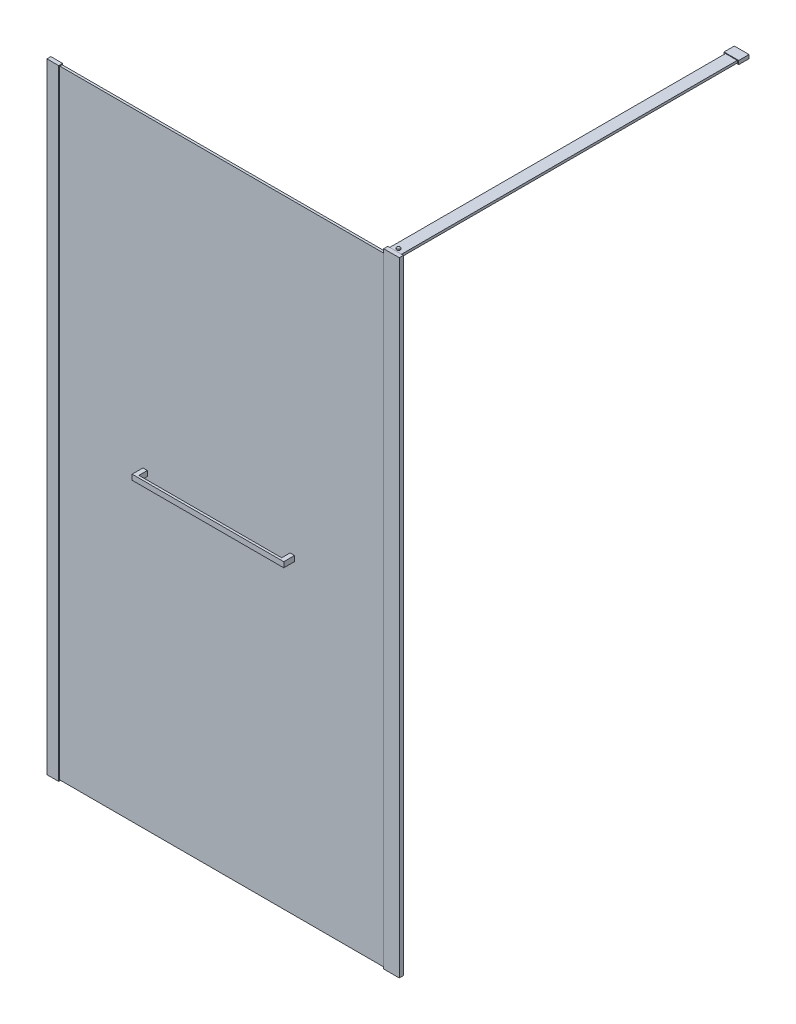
from build123d import *

# Parameters (mm, degrees)
DODANIE_WYCI_GNI_CIE1_START         = 3
DODANIE_WYCI_GNI_CIE1_DEPTH         = 2100
SZKIC2_W                            = 1147
SZKIC2_H                            = 8
DODANIE_WYCI_GNI_CIE2_DEPTH         = 2100
DODANIE_WYCI_GNI_CIE3_DEPTH         = 2108
SZKIC4_W                            = 40
SZKIC4_H                            = 13.3
DODANIE_WYCI_GNI_CIE4_DEPTH         = 3
SZKIC5_W                            = 53
SZKIC5_H                            = 14
DODANIE_WYCI_GNI_CIE5_DEPTH         = 8
DODANIE_WYCI_GNI_CIE6_START         = -1.3
SZKIC6_W                            = 8.1
SZKIC6_H                            = 7.8
DODANIE_WYCI_GNI_CIE6_DEPTH         = 15
SZKIC7_W                            = 53
SZKIC7_H                            = 14
DODANIE_WYCI_GNI_CIE7_DEPTH         = 3
SZKIC8_W                            = 40
SZKIC8_H                            = 13.3
DODANIE_WYCI_GNI_CIE8_DEPTH         = 3
SZKIC9_W                            = 40
SZKIC9_H                            = 8
DODANIE_WYCI_GNI_CIE9_DEPTH         = 1170
DODANIE_WYCI_GNI_CIE10_START        = -29.4
SZKIC10_W                           = 50
SZKIC10_H                           = 12.5
DODANIE_WYCI_GNI_CIE10_DEPTH        = 35
DODANIE_WYCI_GNI_CIE11_DEPTH        = 36.5
DODANIE_WYCI_GNI_CIE11_DEPTH_BACK   = 18
SZKIC12_W                           = 15
SZKIC12_H                           = 18
DODANIE_WYCI_GNI_CIE11_2_DEPTH      = 36.5
DODANIE_WYCI_GNI_CIE11_2_DEPTH_BACK = 18
SZKIC13_W                           = 8
SZKIC13_H                           = 18
DODANIE_WYCI_GNI_CIE12_DEPTH        = 485


with BuildPart() as part:
    # Szkic1 → Dodanie-wyci_gni_cie1 (new body)
    with BuildSketch(Plane(origin=(0, 0, 0), x_dir=(1, 0, 0), z_dir=(0, 1, 0)).offset(DODANIE_WYCI_GNI_CIE1_START)):
        Polygon((0, 0), (0, 13.3), (40, 13.3), (40, 11.4), (6.5, 11.4), (6.5, 3.4), (40, 3.4), (40, 0), align=None)
    extrude(amount=DODANIE_WYCI_GNI_CIE1_DEPTH)

    # Szkic4 → Dodanie-wyci_gni_cie4 (add)
    with BuildSketch(Plane(origin=(0, 2103, 0), x_dir=(1, 0, 0), z_dir=(0, 1, 0))):
        with Locations((20, 6.65)):
            Rectangle(SZKIC4_W, SZKIC4_H)
    extrude(amount=DODANIE_WYCI_GNI_CIE4_DEPTH)

    # Szkic8 → Dodanie-wyci_gni_cie8 (add)
    with BuildSketch(Plane.XZ.offset(-3)):
        with Locations((20, -6.65)):
            Rectangle(SZKIC8_W, SZKIC8_H)
    extrude(amount=DODANIE_WYCI_GNI_CIE8_DEPTH)


with BuildPart() as body_2:
    # Szkic2 → Dodanie-wyci_gni_cie2 (new body)
    with BuildSketch(Plane.XZ.offset(-3)):
        with Locations((580, -7.4)):
            Rectangle(SZKIC2_W, SZKIC2_H)
    extrude(amount=-DODANIE_WYCI_GNI_CIE2_DEPTH)


with BuildPart() as body_3:
    # Szkic3 → Dodanie-wyci_gni_cie3 (new body)
    with BuildSketch(Plane.XZ.offset(-3)):
        Polygon((1143.4, -3.4), (1143.4, -0.4), (1196.4, -0.4), (1196.4, -14.4), (1143.4, -14.4), (1143.4, -11.4), (1153.5, -11.4), (1153.5, -3.4), align=None)
    extrude(amount=-DODANIE_WYCI_GNI_CIE3_DEPTH)

    # Szkic5 → Dodanie-wyci_gni_cie5 (add)
    with BuildSketch(Plane(origin=(0, 2111, 0), x_dir=(1, 0, 0), z_dir=(0, 1, 0))):
        with Locations((1169.9, 7.4)):
            Rectangle(SZKIC5_W, SZKIC5_H)
    extrude(amount=DODANIE_WYCI_GNI_CIE5_DEPTH)

    # Szkic6 → Dodanie-wyci_gni_cie6 (add)
    with BuildSketch(Plane.ZY.offset(-1143.4).offset(DODANIE_WYCI_GNI_CIE6_START)):
        with Locations((-7.4, 2107.1)):
            Rectangle(SZKIC6_W, SZKIC6_H)
    extrude(amount=-DODANIE_WYCI_GNI_CIE6_DEPTH)

    # Szkic7 → Dodanie-wyci_gni_cie7 (add)
    with BuildSketch(Plane.XZ.offset(-3)):
        with Locations((1169.9, -7.4)):
            Rectangle(SZKIC7_W, SZKIC7_H)
    extrude(amount=DODANIE_WYCI_GNI_CIE7_DEPTH)


with BuildPart() as body_4:
    # Szkic9 → Dodanie-wyci_gni_cie9 (new body)
    with BuildSketch(Plane(origin=(0, 0, -14.4), x_dir=(-1, 0, 0), z_dir=(0, 0, -1))):
        with Locations((-1169.9, 2115)):
            Rectangle(SZKIC9_W, SZKIC9_H)
    extrude(amount=DODANIE_WYCI_GNI_CIE9_DEPTH)

    # Szkic10 → Dodanie-wyci_gni_cie10 (add)
    with BuildSketch(Plane(origin=(0, 0, -1184.4), x_dir=(-1, 0, 0), z_dir=(0, 0, -1)).offset(DODANIE_WYCI_GNI_CIE10_START)):
        with Locations((-1169.9, 2115)):
            Rectangle(SZKIC10_W, SZKIC10_H)
    extrude(amount=DODANIE_WYCI_GNI_CIE10_DEPTH)

    # Szkic11 → Obr_t1 (revolve)
    with BuildSketch(Plane(origin=(1169.9, 0, 0), x_dir=(0, 0, -1), z_dir=(1, 0, 0))):
        with BuildLine():
            Line((30.3, 2119), (30.05, 2122.8))
            ThreePointArc((30.05, 2122.8), (27.38045718, 2124.212280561), (24.4, 2124.7))
            Line((24.4, 2124.7), (24.4, 2124.2))
            ThreePointArc((24.4, 2124.2), (27.113886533, 2123.773650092), (29.566308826, 2122.535676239))
            Line((29.566308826, 2122.535676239), (29.798919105, 2119))
            Line((29.798919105, 2119), (30.3, 2119))
        make_face()
    revolve(axis=Axis((1169.9, 2119, -24.4), (0, 1, 0)))


with BuildPart() as body_5:
    # Szkic12 → Dodanie-wyci_gni_cie11 (new, two sides: drawn at the far end of the back side and taken through both)
    with BuildSketch(Plane.XY.offset(-3.4).offset(-DODANIE_WYCI_GNI_CIE11_DEPTH_BACK)):
        with Locations((330, 1053)):
            Rectangle(SZKIC12_W, SZKIC12_H)
    extrude(amount=DODANIE_WYCI_GNI_CIE11_DEPTH + DODANIE_WYCI_GNI_CIE11_DEPTH_BACK)



with BuildPart() as body_6:
    # Szkic12 → Dodanie-wyci_gni_cie11 2 (new, two sides: drawn at the far end of the back side and taken through both)
    with BuildSketch(Plane.XY.offset(-3.4).offset(-DODANIE_WYCI_GNI_CIE11_2_DEPTH_BACK)):
        with Locations((830, 1053)):
            Rectangle(SZKIC12_W, SZKIC12_H)
    extrude(amount=DODANIE_WYCI_GNI_CIE11_2_DEPTH + DODANIE_WYCI_GNI_CIE11_2_DEPTH_BACK)


with BuildPart() as body_5_1:
    add(body_5.part)

    add(body_6.part)  # Dodanie-wyci_gni_cie12 merges body 6
    # Szkic13 → Dodanie-wyci_gni_cie12 (add)
    with BuildSketch(Plane(origin=(337.5, 0, 0), x_dir=(0, 0, -1), z_dir=(1, 0, 0))):
        with Locations((-29.1, 1053)):
            Rectangle(SZKIC13_W, SZKIC13_H)
    extrude(amount=DODANIE_WYCI_GNI_CIE12_DEPTH)


solid = Compound([part.part, body_2.part, body_3.part, body_4.part, body_5_1.part])
